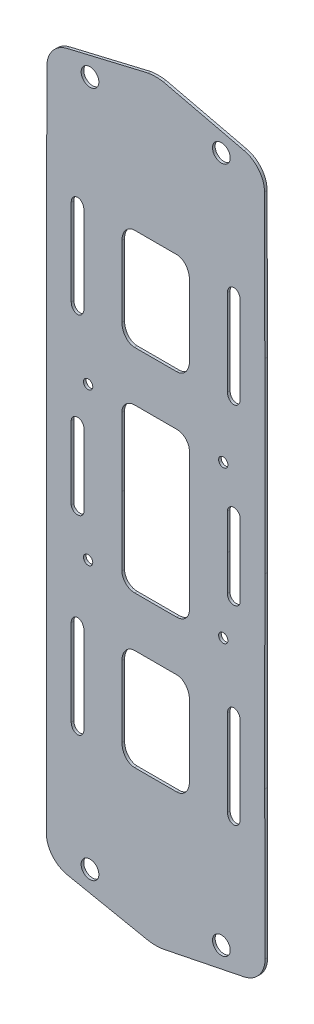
from build123d import *

# Parameters (mm, degrees)
SKETCH_1_R      = 0.88
SKETCH_1_R_2    = 1.68
EXTRUDE_3_DEPTH = 0.5


with BuildPart() as part:
    # Sketch 1 → Extrude 3 (new body)
    with BuildSketch(Plane.XY):
        with BuildLine():
            Line((20.655794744, 35.301413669), (20.600838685, 62.626713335))
            ThreePointArc((20.600838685, 62.626713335), (19.519434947, 65.72224639), (16.752763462, 67.482157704))
            Line((16.752763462, 67.482157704), (1.43574764, 71.108484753))
            ThreePointArc((1.43574764, 71.108484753), (0.720287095, 71.196804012), (0, 71.226309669))
            ThreePointArc((0, 71.226309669), (-0.720287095, 71.196804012), (-1.43574764, 71.108484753))
            Line((-1.43574764, 71.108484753), (-16.752763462, 67.482157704))
            ThreePointArc((-16.752763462, 67.482157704), (-19.519434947, 65.72224639), (-20.600838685, 62.626713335))
            Line((-20.600838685, 62.626713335), (-20.655794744, 35.301413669))
            Line((-20.655794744, 35.301413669), (-20.655794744, 0))
            Line((-20.655794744, 0), (-20.638237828, -35.266493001))
            Line((-20.638237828, -35.266493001), (-20.70624052, -63.100789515))
            ThreePointArc((-20.70624052, -63.100789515), (-19.580825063, -66.27333899), (-16.699202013, -68.013419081))
            Line((-16.699202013, -68.013419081), (-1.346179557, -71.124325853))
            ThreePointArc((-1.346179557, -71.124325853), (-0.675075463, -71.201897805), (0, -71.227805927))
            ThreePointArc((0, -71.227805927), (0.675075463, -71.201897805), (1.346179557, -71.124325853))
            Line((1.346179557, -71.124325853), (16.699202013, -68.013419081))
            ThreePointArc((16.699202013, -68.013419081), (19.580825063, -66.27333899), (20.70624052, -63.100789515))
            Line((20.70624052, -63.100789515), (20.638237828, -35.266493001))
            Line((20.638237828, -35.266493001), (20.655794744, 0))
            Line((20.655794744, 0), (20.655794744, 35.301413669))
        make_face()
        with Locations((12.792, 14.401562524)):
            Circle(SKETCH_1_R, mode=Mode.SUBTRACT)
        with Locations((12.437009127, 64.958952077)):
            Circle(SKETCH_1_R_2, mode=Mode.SUBTRACT)
        with Locations(Location((12.437009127, -64.958952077, 0), (0, 0, 180))):
            Circle(SKETCH_1_R_2, mode=Mode.SUBTRACT)
        with Locations(Location((12.792, -14.401562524, 0), (0, 0, 180))):
            Circle(SKETCH_1_R, mode=Mode.SUBTRACT)
        with Locations((-12.792, -14.401562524)):
            Circle(SKETCH_1_R, mode=Mode.SUBTRACT)
        with Locations((-12.437009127, -64.958952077)):
            Circle(SKETCH_1_R_2, mode=Mode.SUBTRACT)
        with Locations(Location((-12.437009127, 64.958952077, 0), (0, 0, 180))):
            Circle(SKETCH_1_R_2, mode=Mode.SUBTRACT)
        with Locations(Location((-12.792, 14.401562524, 0), (0, 0, 180))):
            Circle(SKETCH_1_R, mode=Mode.SUBTRACT)
        with BuildLine():
            Line((-15.992, 0), (-15.992, -7.014435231))
            ThreePointArc((-15.992, -7.014435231), (-14.650041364, -8.012001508), (-13.575309, -6.731009))
            Line((-13.575309, -6.731009), (-13.592, 0))
            Line((-13.592, 0), (-13.592, 6.801562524))
            ThreePointArc((-13.592, 6.801562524), (-14.792, 8.001562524), (-15.992, 6.801562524))
            Line((-15.992, 6.801562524), (-15.992, 0))
        make_face(mode=Mode.SUBTRACT)
        with BuildLine():
            Line((15.992, 6.801562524), (15.992, 0))
            Line((15.992, 0), (15.992, -7.014435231))
            ThreePointArc((15.992, -7.014435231), (14.650041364, -8.012001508), (13.575309, -6.731009))
            Line((13.575309, -6.731009), (13.592, 0))
            Line((13.592, 0), (13.592, 6.801562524))
            ThreePointArc((13.592, 6.801562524), (14.792, 8.001562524), (15.992, 6.801562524))
        make_face(mode=Mode.SUBTRACT)
        with BuildLine():
            Line((15.992, 42.610628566), (15.992, 26.290628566))
            add(Edge.make_bspline(
                [(13.592, 26.290628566), (13.592, 24.850628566), (14.792, 24.850628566), (15.992, 24.850628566), (15.992, 26.290628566)],
                knots=[1.570796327, 1.570796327, 1.570796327, 3.141592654, 3.141592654, 4.71238898, 4.71238898, 4.71238898], degree=2, weights=[1, 0.707106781, 1, 0.707106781, 1]))
            Line((13.592, 26.290628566), (13.592, 42.610628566))
            add(Edge.make_bspline(
                [(15.992, 42.610628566), (15.992, 44.050628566), (14.792, 44.050628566), (13.592, 44.050628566), (13.592, 42.610628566)],
                knots=[4.71238898, 4.71238898, 4.71238898, 6.283185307, 6.283185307, 7.853981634, 7.853981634, 7.853981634], degree=2, weights=[1, 0.707106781, 1, 0.707106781, 1]))
        make_face(mode=Mode.SUBTRACT)
        with BuildLine():
            Line((-6.392, 0), (-6.392314, -13.002299))
            ThreePointArc((-6.392314, -13.002299), (-5.675231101, -14.712772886), (-3.953169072, -15.401562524))
            Line((-3.953169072, -15.401562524), (3.953169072, -15.401562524))
            ThreePointArc((3.953169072, -15.401562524), (5.675231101, -14.712772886), (6.392314, -13.002299))
            Line((6.392314, -13.002299), (6.392, 0))
            Line((6.392, 0), (6.392, 13.001562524))
            ThreePointArc((6.392, 13.001562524), (5.689056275, 14.698618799), (3.992, 15.401562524))
            Line((3.992, 15.401562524), (-3.992, 15.401562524))
            ThreePointArc((-3.992, 15.401562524), (-5.689056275, 14.698618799), (-6.392, 13.001562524))
            Line((-6.392, 13.001562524), (-6.392, 0))
        make_face(mode=Mode.SUBTRACT)
        with BuildLine():
            Line((6.392, -41.170628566), (6.392, -27.730628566))
            add(Edge.make_bspline(
                [(6.392, -27.730628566), (6.392, -24.850628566), (3.992, -24.850628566)],
                knots=[4.71238898, 4.71238898, 4.71238898, 6.283185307, 6.283185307, 6.283185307], degree=2, weights=[1, 0.707106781, 1]))
            Line((3.992, -24.850628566), (-3.992, -24.850628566))
            add(Edge.make_bspline(
                [(-3.992, -24.850628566), (-6.392, -24.850628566), (-6.392, -27.730628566)],
                knots=[0, 0, 0, 1.570796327, 1.570796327, 1.570796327], degree=2, weights=[1, 0.707106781, 1]))
            Line((-6.392, -27.730628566), (-6.392, -41.170628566))
            add(Edge.make_bspline(
                [(-6.392, -41.170628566), (-6.392, -44.050628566), (-3.992, -44.050628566)],
                knots=[1.570796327, 1.570796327, 1.570796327, 3.141592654, 3.141592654, 3.141592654], degree=2, weights=[1, 0.707106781, 1]))
            Line((-3.992, -44.050628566), (3.992, -44.050628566))
            add(Edge.make_bspline(
                [(3.992, -44.050628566), (6.392, -44.050628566), (6.392, -41.170628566)],
                knots=[3.141592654, 3.141592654, 3.141592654, 4.71238898, 4.71238898, 4.71238898], degree=2, weights=[1, 0.707106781, 1]))
        make_face(mode=Mode.SUBTRACT)
        with BuildLine():
            Line((-3.992, 24.850628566), (3.992, 24.850628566))
            add(Edge.make_bspline(
                [(3.992, 24.850628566), (6.392, 24.850628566), (6.392, 27.730628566)],
                knots=[0, 0, 0, 1.570796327, 1.570796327, 1.570796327], degree=2, weights=[1, 0.707106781, 1]))
            Line((6.392, 27.730628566), (6.392, 41.170628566))
            add(Edge.make_bspline(
                [(6.392, 41.170628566), (6.392, 44.050628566), (3.992, 44.050628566)],
                knots=[4.71238898, 4.71238898, 4.71238898, 6.283185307, 6.283185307, 6.283185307], degree=2, weights=[1, 0.707106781, 1]))
            Line((3.992, 44.050628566), (-3.992, 44.050628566))
            add(Edge.make_bspline(
                [(-3.992, 44.050628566), (-6.392, 44.050628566), (-6.392, 41.170628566)],
                knots=[3.141592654, 3.141592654, 3.141592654, 4.71238898, 4.71238898, 4.71238898], degree=2, weights=[1, 0.707106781, 1]))
            Line((-6.392, 41.170628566), (-6.392, 27.730628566))
            add(Edge.make_bspline(
                [(-6.392, 27.730628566), (-6.392, 24.850628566), (-3.992, 24.850628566)],
                knots=[4.71238898, 4.71238898, 4.71238898, 6.283185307, 6.283185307, 6.283185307], degree=2, weights=[1, 0.707106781, 1]))
        make_face(mode=Mode.SUBTRACT)
        with BuildLine():
            Line((13.592, -26.290628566), (13.592, -42.610628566))
            add(Edge.make_bspline(
                [(13.592, -42.610628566), (13.592, -44.050628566), (14.792, -44.050628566), (15.992, -44.050628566), (15.992, -42.610628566)],
                knots=[1.570796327, 1.570796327, 1.570796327, 3.141592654, 3.141592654, 4.71238898, 4.71238898, 4.71238898], degree=2, weights=[1, 0.707106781, 1, 0.707106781, 1]))
            Line((15.992, -42.610628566), (15.992, -26.290628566))
            add(Edge.make_bspline(
                [(15.992, -26.290628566), (15.992, -24.850628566), (14.792, -24.850628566), (13.592, -24.850628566), (13.592, -26.290628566)],
                knots=[4.71238898, 4.71238898, 4.71238898, 6.283185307, 6.283185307, 7.853981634, 7.853981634, 7.853981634], degree=2, weights=[1, 0.707106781, 1, 0.707106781, 1]))
        make_face(mode=Mode.SUBTRACT)
        with BuildLine():
            Line((-15.992, -42.610628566), (-15.992, -26.290628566))
            add(Edge.make_bspline(
                [(-13.592, -26.290628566), (-13.592, -24.850628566), (-14.792, -24.850628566), (-15.992, -24.850628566), (-15.992, -26.290628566)],
                knots=[4.71238898, 4.71238898, 4.71238898, 6.283185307, 6.283185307, 7.853981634, 7.853981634, 7.853981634], degree=2, weights=[1, 0.707106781, 1, 0.707106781, 1]))
            Line((-13.592, -26.290628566), (-13.592, -42.610628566))
            add(Edge.make_bspline(
                [(-15.992, -42.610628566), (-15.992, -44.050628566), (-14.792, -44.050628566), (-13.592, -44.050628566), (-13.592, -42.610628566)],
                knots=[1.570796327, 1.570796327, 1.570796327, 3.141592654, 3.141592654, 4.71238898, 4.71238898, 4.71238898], degree=2, weights=[1, 0.707106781, 1, 0.707106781, 1]))
        make_face(mode=Mode.SUBTRACT)
        with BuildLine():
            Line((-13.592, 26.290628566), (-13.592, 42.610628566))
            add(Edge.make_bspline(
                [(-13.592, 42.610628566), (-13.592, 44.050628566), (-14.792, 44.050628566), (-15.992, 44.050628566), (-15.992, 42.610628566)],
                knots=[1.570796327, 1.570796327, 1.570796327, 3.141592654, 3.141592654, 4.71238898, 4.71238898, 4.71238898], degree=2, weights=[1, 0.707106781, 1, 0.707106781, 1]))
            Line((-15.992, 42.610628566), (-15.992, 26.290628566))
            add(Edge.make_bspline(
                [(-15.992, 26.290628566), (-15.992, 24.850628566), (-14.792, 24.850628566), (-13.592, 24.850628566), (-13.592, 26.290628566)],
                knots=[4.71238898, 4.71238898, 4.71238898, 6.283185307, 6.283185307, 7.853981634, 7.853981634, 7.853981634], degree=2, weights=[1, 0.707106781, 1, 0.707106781, 1]))
        make_face(mode=Mode.SUBTRACT)
    extrude(amount=EXTRUDE_3_DEPTH)


solid = part.part
